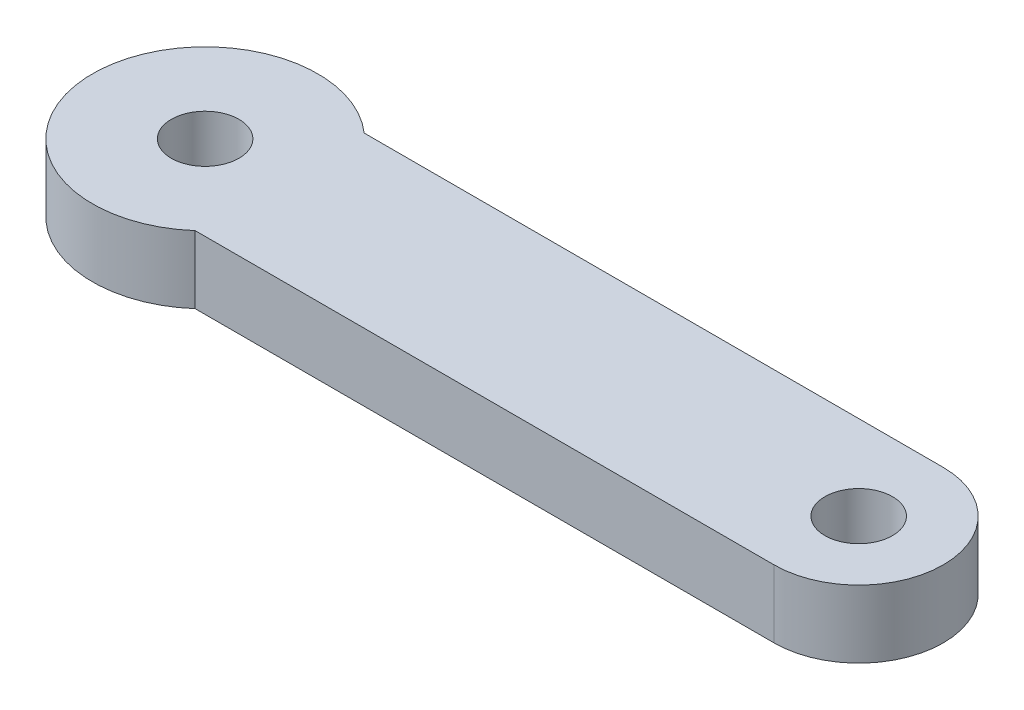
ISO-10303-21;
HEADER;
FILE_DESCRIPTION(('STEP AP214'),'2;1');
FILE_NAME('part.step','',(''),(''),'','','');
FILE_SCHEMA(('AUTOMOTIVE_DESIGN { 1 0 10303 214 1 1 1 1 }'));
ENDSEC;
DATA;
#1=APPLICATION_CONTEXT('core data for automotive mechanical design processes');
#2=APPLICATION_PROTOCOL_DEFINITION('international standard','automotive_design',2000,#1);
#3=PRODUCT_CONTEXT('',#1,'mechanical');
#4=PRODUCT('Part','Part','',(#3));
#5=PRODUCT_RELATED_PRODUCT_CATEGORY('part','',(#4));
#6=PRODUCT_DEFINITION_FORMATION('','',#4);
#7=PRODUCT_DEFINITION_CONTEXT('part definition',#1,'design');
#8=PRODUCT_DEFINITION('design','',#6,#7);
#9=PRODUCT_DEFINITION_SHAPE('','',#8);
#10=(LENGTH_UNIT() NAMED_UNIT(*) SI_UNIT(.MILLI.,.METRE.));
#11=(NAMED_UNIT(*) PLANE_ANGLE_UNIT() SI_UNIT($,.RADIAN.));
#12=(NAMED_UNIT(*) SI_UNIT($,.STERADIAN.) SOLID_ANGLE_UNIT());
#13=UNCERTAINTY_MEASURE_WITH_UNIT(LENGTH_MEASURE(1.E-05),#10,'distance_accuracy_value','');
#14=(GEOMETRIC_REPRESENTATION_CONTEXT(3) GLOBAL_UNCERTAINTY_ASSIGNED_CONTEXT((#13)) GLOBAL_UNIT_ASSIGNED_CONTEXT((#10,
#11,#12)) REPRESENTATION_CONTEXT('',''));
#15=CARTESIAN_POINT('',(0.,0.,0.));
#16=DIRECTION('',(0.,0.,1.));
#17=DIRECTION('',(1.,0.,0.));
#18=AXIS2_PLACEMENT_3D('',#15,#16,#17);
#19=CARTESIAN_POINT('',(58.,6.,0.));
#20=DIRECTION('',(0.,1.,0.));
#21=DIRECTION('',(0.,0.,1.));
#22=AXIS2_PLACEMENT_3D('',#19,#20,#21);
#23=PLANE('',#22);
#24=CARTESIAN_POINT('',(0.,6.,0.));
#25=DIRECTION('',(0.,1.,0.));
#26=DIRECTION('',(0.,0.,1.));
#27=AXIS2_PLACEMENT_3D('',#24,#25,#26);
#28=CIRCLE('',#27,3.);
#29=CARTESIAN_POINT('',(0.,6.,3.));
#30=VERTEX_POINT('',#29);
#31=EDGE_CURVE('E76',#30,#30,#28,.T.);
#32=ORIENTED_EDGE('',*,*,#31,.F.);
#33=EDGE_LOOP('',(#32));
#34=FACE_BOUND('',#33,.T.);
#35=CARTESIAN_POINT('',(58.,6.,0.));
#36=DIRECTION('',(0.,1.,0.));
#37=DIRECTION('',(0.,0.,1.));
#38=AXIS2_PLACEMENT_3D('',#35,#36,#37);
#39=CIRCLE('',#38,7.5);
#40=CARTESIAN_POINT('',(58.,6.,7.5));
#41=VERTEX_POINT('',#40);
#42=CARTESIAN_POINT('',(58.,6.,-7.5));
#43=VERTEX_POINT('',#42);
#44=EDGE_CURVE('E86',#41,#43,#39,.T.);
#45=ORIENTED_EDGE('',*,*,#44,.T.);
#46=DIRECTION('',(-1.,0.,0.));
#47=VECTOR('',#46,1.);
#48=CARTESIAN_POINT('',(58.,6.,-7.5));
#49=LINE('',#48,#47);
#50=CARTESIAN_POINT('',(6.61437827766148,6.,-7.5));
#51=VERTEX_POINT('',#50);
#52=EDGE_CURVE('E71',#43,#51,#49,.T.);
#53=ORIENTED_EDGE('',*,*,#52,.T.);
#54=CARTESIAN_POINT('',(0.,6.,0.));
#55=DIRECTION('',(0.,1.,0.));
#56=DIRECTION('',(0.,0.,1.));
#57=AXIS2_PLACEMENT_3D('',#54,#55,#56);
#58=CIRCLE('',#57,10.);
#59=CARTESIAN_POINT('',(6.61437827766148,6.,7.5));
#60=VERTEX_POINT('',#59);
#61=EDGE_CURVE('E37',#51,#60,#58,.T.);
#62=ORIENTED_EDGE('',*,*,#61,.T.);
#63=DIRECTION('',(1.,0.,0.));
#64=VECTOR('',#63,1.);
#65=CARTESIAN_POINT('',(58.,6.,7.5));
#66=LINE('',#65,#64);
#67=EDGE_CURVE('E32',#60,#41,#66,.T.);
#68=ORIENTED_EDGE('',*,*,#67,.T.);
#69=EDGE_LOOP('',(#45,#53,#62,#68));
#70=FACE_BOUND('',#69,.T.);
#71=CARTESIAN_POINT('',(58.,6.,0.));
#72=DIRECTION('',(0.,1.,0.));
#73=DIRECTION('',(0.,0.,1.));
#74=AXIS2_PLACEMENT_3D('',#71,#72,#73);
#75=CIRCLE('',#74,2.99999999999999);
#76=CARTESIAN_POINT('',(58.,6.,2.99999999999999));
#77=VERTEX_POINT('',#76);
#78=EDGE_CURVE('E104',#77,#77,#75,.T.);
#79=ORIENTED_EDGE('',*,*,#78,.F.);
#80=EDGE_LOOP('',(#79));
#81=FACE_BOUND('',#80,.T.);
#82=ADVANCED_FACE('F17',(#34,#70,#81),#23,.T.);
#83=CARTESIAN_POINT('',(58.,0.,0.));
#84=DIRECTION('',(0.,1.,0.));
#85=DIRECTION('',(0.,0.,1.));
#86=AXIS2_PLACEMENT_3D('',#83,#84,#85);
#87=PLANE('',#86);
#88=CARTESIAN_POINT('',(0.,0.,0.));
#89=DIRECTION('',(0.,1.,0.));
#90=DIRECTION('',(0.,0.,1.));
#91=AXIS2_PLACEMENT_3D('',#88,#89,#90);
#92=CIRCLE('',#91,3.);
#93=CARTESIAN_POINT('',(0.,0.,3.));
#94=VERTEX_POINT('',#93);
#95=EDGE_CURVE('E79',#94,#94,#92,.T.);
#96=ORIENTED_EDGE('',*,*,#95,.T.);
#97=EDGE_LOOP('',(#96));
#98=FACE_BOUND('',#97,.T.);
#99=CARTESIAN_POINT('',(58.,0.,0.));
#100=DIRECTION('',(0.,1.,0.));
#101=DIRECTION('',(0.,0.,1.));
#102=AXIS2_PLACEMENT_3D('',#99,#100,#101);
#103=CIRCLE('',#102,7.5);
#104=CARTESIAN_POINT('',(58.,0.,7.5));
#105=VERTEX_POINT('',#104);
#106=CARTESIAN_POINT('',(58.,0.,-7.5));
#107=VERTEX_POINT('',#106);
#108=EDGE_CURVE('E63',#105,#107,#103,.T.);
#109=ORIENTED_EDGE('',*,*,#108,.F.);
#110=DIRECTION('',(1.,0.,0.));
#111=VECTOR('',#110,1.);
#112=CARTESIAN_POINT('',(58.,0.,7.5));
#113=LINE('',#112,#111);
#114=CARTESIAN_POINT('',(6.61437827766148,0.,7.5));
#115=VERTEX_POINT('',#114);
#116=EDGE_CURVE('E84',#115,#105,#113,.T.);
#117=ORIENTED_EDGE('',*,*,#116,.F.);
#118=CARTESIAN_POINT('',(0.,0.,0.));
#119=DIRECTION('',(0.,1.,0.));
#120=DIRECTION('',(0.,0.,1.));
#121=AXIS2_PLACEMENT_3D('',#118,#119,#120);
#122=CIRCLE('',#121,10.);
#123=CARTESIAN_POINT('',(6.61437827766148,0.,-7.5));
#124=VERTEX_POINT('',#123);
#125=EDGE_CURVE('E64',#124,#115,#122,.T.);
#126=ORIENTED_EDGE('',*,*,#125,.F.);
#127=DIRECTION('',(-1.,0.,0.));
#128=VECTOR('',#127,1.);
#129=CARTESIAN_POINT('',(58.,0.,-7.5));
#130=LINE('',#129,#128);
#131=EDGE_CURVE('E58',#107,#124,#130,.T.);
#132=ORIENTED_EDGE('',*,*,#131,.F.);
#133=EDGE_LOOP('',(#109,#117,#126,#132));
#134=FACE_BOUND('',#133,.T.);
#135=CARTESIAN_POINT('',(58.,0.,0.));
#136=DIRECTION('',(0.,1.,0.));
#137=DIRECTION('',(0.,0.,1.));
#138=AXIS2_PLACEMENT_3D('',#135,#136,#137);
#139=CIRCLE('',#138,2.99999999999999);
#140=CARTESIAN_POINT('',(58.,0.,2.99999999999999));
#141=VERTEX_POINT('',#140);
#142=EDGE_CURVE('E106',#141,#141,#139,.T.);
#143=ORIENTED_EDGE('',*,*,#142,.T.);
#144=EDGE_LOOP('',(#143));
#145=FACE_BOUND('',#144,.T.);
#146=ADVANCED_FACE('F59',(#98,#134,#145),#87,.F.);
#147=CARTESIAN_POINT('',(58.,6.,0.));
#148=DIRECTION('',(0.,-1.,0.));
#149=DIRECTION('',(0.,0.,-1.));
#150=AXIS2_PLACEMENT_3D('',#147,#148,#149);
#151=CYLINDRICAL_SURFACE('',#150,7.5);
#152=ORIENTED_EDGE('',*,*,#108,.T.);
#153=DIRECTION('',(0.,-1.,0.));
#154=VECTOR('',#153,1.);
#155=CARTESIAN_POINT('',(58.,6.,-7.5));
#156=LINE('',#155,#154);
#157=EDGE_CURVE('E11',#43,#107,#156,.T.);
#158=ORIENTED_EDGE('',*,*,#157,.F.);
#159=ORIENTED_EDGE('',*,*,#44,.F.);
#160=DIRECTION('',(0.,-1.,0.));
#161=VECTOR('',#160,1.);
#162=CARTESIAN_POINT('',(58.,6.,7.5));
#163=LINE('',#162,#161);
#164=EDGE_CURVE('E75',#41,#105,#163,.T.);
#165=ORIENTED_EDGE('',*,*,#164,.T.);
#166=EDGE_LOOP('',(#152,#158,#159,#165));
#167=FACE_BOUND('',#166,.T.);
#168=ADVANCED_FACE('F19',(#167),#151,.T.);
#169=CARTESIAN_POINT('',(58.,6.,-7.5));
#170=DIRECTION('',(0.,0.,1.));
#171=DIRECTION('',(1.,0.,0.));
#172=AXIS2_PLACEMENT_3D('',#169,#170,#171);
#173=PLANE('',#172);
#174=ORIENTED_EDGE('',*,*,#131,.T.);
#175=DIRECTION('',(0.,-1.,0.));
#176=VECTOR('',#175,1.);
#177=CARTESIAN_POINT('',(6.61437827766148,6.,-7.5));
#178=LINE('',#177,#176);
#179=EDGE_CURVE('E25',#51,#124,#178,.T.);
#180=ORIENTED_EDGE('',*,*,#179,.F.);
#181=ORIENTED_EDGE('',*,*,#52,.F.);
#182=ORIENTED_EDGE('',*,*,#157,.T.);
#183=EDGE_LOOP('',(#174,#180,#181,#182));
#184=FACE_BOUND('',#183,.T.);
#185=ADVANCED_FACE('F70',(#184),#173,.F.);
#186=CARTESIAN_POINT('',(0.,6.,0.));
#187=DIRECTION('',(0.,-1.,0.));
#188=DIRECTION('',(0.,0.,-1.));
#189=AXIS2_PLACEMENT_3D('',#186,#187,#188);
#190=CYLINDRICAL_SURFACE('',#189,10.);
#191=ORIENTED_EDGE('',*,*,#125,.T.);
#192=DIRECTION('',(0.,-1.,0.));
#193=VECTOR('',#192,1.);
#194=CARTESIAN_POINT('',(6.61437827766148,6.,7.5));
#195=LINE('',#194,#193);
#196=EDGE_CURVE('E92',#60,#115,#195,.T.);
#197=ORIENTED_EDGE('',*,*,#196,.F.);
#198=ORIENTED_EDGE('',*,*,#61,.F.);
#199=ORIENTED_EDGE('',*,*,#179,.T.);
#200=EDGE_LOOP('',(#191,#197,#198,#199));
#201=FACE_BOUND('',#200,.T.);
#202=ADVANCED_FACE('F95',(#201),#190,.T.);
#203=CARTESIAN_POINT('',(58.,6.,7.5));
#204=DIRECTION('',(0.,0.,-1.));
#205=DIRECTION('',(-1.,0.,0.));
#206=AXIS2_PLACEMENT_3D('',#203,#204,#205);
#207=PLANE('',#206);
#208=ORIENTED_EDGE('',*,*,#116,.T.);
#209=ORIENTED_EDGE('',*,*,#164,.F.);
#210=ORIENTED_EDGE('',*,*,#67,.F.);
#211=ORIENTED_EDGE('',*,*,#196,.T.);
#212=EDGE_LOOP('',(#208,#209,#210,#211));
#213=FACE_BOUND('',#212,.T.);
#214=ADVANCED_FACE('F97',(#213),#207,.F.);
#215=CARTESIAN_POINT('',(0.,6.,0.));
#216=DIRECTION('',(0.,-1.,0.));
#217=DIRECTION('',(0.,0.,-1.));
#218=AXIS2_PLACEMENT_3D('',#215,#216,#217);
#219=CYLINDRICAL_SURFACE('',#218,3.);
#220=ORIENTED_EDGE('',*,*,#31,.T.);
#221=EDGE_LOOP('',(#220));
#222=FACE_BOUND('',#221,.T.);
#223=ORIENTED_EDGE('',*,*,#95,.F.);
#224=EDGE_LOOP('',(#223));
#225=FACE_BOUND('',#224,.T.);
#226=ADVANCED_FACE('F115',(#222,#225),#219,.F.);
#227=CARTESIAN_POINT('',(58.,6.,0.));
#228=DIRECTION('',(0.,-1.,0.));
#229=DIRECTION('',(0.,0.,-1.));
#230=AXIS2_PLACEMENT_3D('',#227,#228,#229);
#231=CYLINDRICAL_SURFACE('',#230,2.99999999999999);
#232=ORIENTED_EDGE('',*,*,#78,.T.);
#233=EDGE_LOOP('',(#232));
#234=FACE_BOUND('',#233,.T.);
#235=ORIENTED_EDGE('',*,*,#142,.F.);
#236=EDGE_LOOP('',(#235));
#237=FACE_BOUND('',#236,.T.);
#238=ADVANCED_FACE('F113',(#234,#237),#231,.F.);
#239=CLOSED_SHELL('',(#82,#146,#168,#185,#202,#214,#226,#238));
#240=MANIFOLD_SOLID_BREP('B1',#239);
#241=ADVANCED_BREP_SHAPE_REPRESENTATION('',(#18,#240),#14);
#242=SHAPE_DEFINITION_REPRESENTATION(#9,#241);
ENDSEC;
END-ISO-10303-21;
